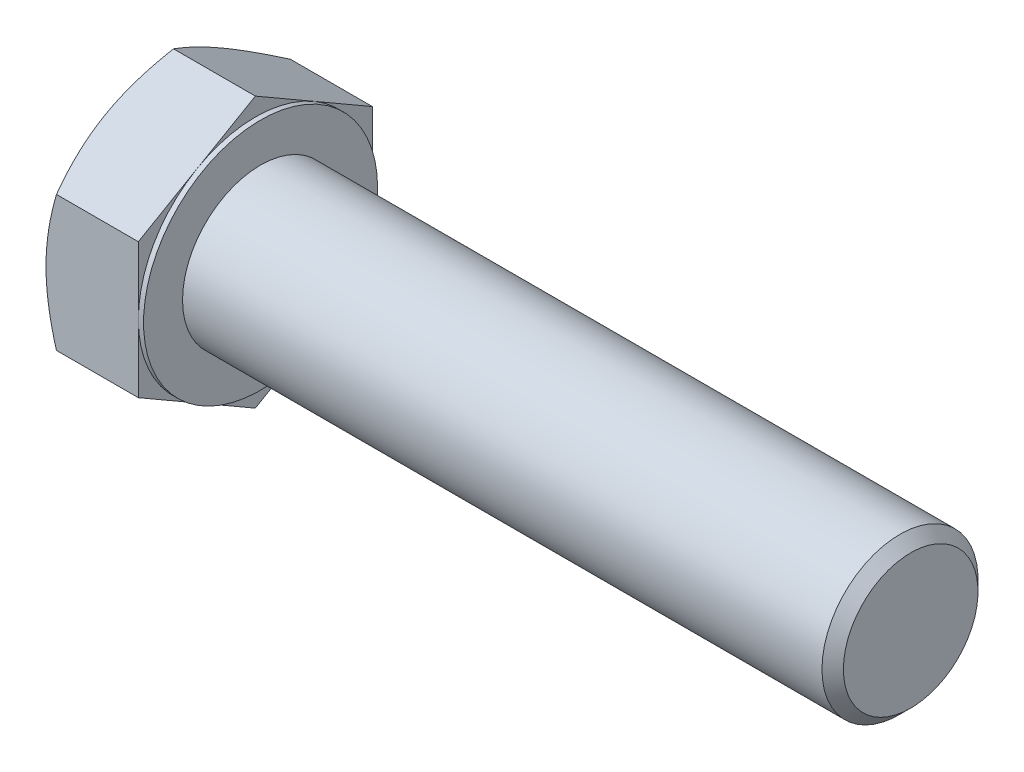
ISO-10303-21;
HEADER;
FILE_DESCRIPTION(('STEP AP214'),'2;1');
FILE_NAME('part.step','',(''),(''),'','','');
FILE_SCHEMA(('AUTOMOTIVE_DESIGN { 1 0 10303 214 1 1 1 1 }'));
ENDSEC;
DATA;
#1=APPLICATION_CONTEXT('core data for automotive mechanical design processes');
#2=APPLICATION_PROTOCOL_DEFINITION('international standard','automotive_design',2000,#1);
#3=PRODUCT_CONTEXT('',#1,'mechanical');
#4=PRODUCT('Part','Part','',(#3));
#5=PRODUCT_RELATED_PRODUCT_CATEGORY('part','',(#4));
#6=PRODUCT_DEFINITION_FORMATION('','',#4);
#7=PRODUCT_DEFINITION_CONTEXT('part definition',#1,'design');
#8=PRODUCT_DEFINITION('design','',#6,#7);
#9=PRODUCT_DEFINITION_SHAPE('','',#8);
#10=(LENGTH_UNIT() NAMED_UNIT(*) SI_UNIT(.MILLI.,.METRE.));
#11=(NAMED_UNIT(*) PLANE_ANGLE_UNIT() SI_UNIT($,.RADIAN.));
#12=(NAMED_UNIT(*) SI_UNIT($,.STERADIAN.) SOLID_ANGLE_UNIT());
#13=UNCERTAINTY_MEASURE_WITH_UNIT(LENGTH_MEASURE(1.E-05),#10,'distance_accuracy_value','');
#14=(GEOMETRIC_REPRESENTATION_CONTEXT(3) GLOBAL_UNCERTAINTY_ASSIGNED_CONTEXT((#13)) GLOBAL_UNIT_ASSIGNED_CONTEXT((#10,
#11,#12)) REPRESENTATION_CONTEXT('',''));
#15=CARTESIAN_POINT('',(0.,0.,0.));
#16=DIRECTION('',(0.,0.,1.));
#17=DIRECTION('',(1.,0.,0.));
#18=AXIS2_PLACEMENT_3D('',#15,#16,#17);
#19=CARTESIAN_POINT('',(15.,20.7846096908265,0.));
#20=DIRECTION('',(1.,0.,0.));
#21=DIRECTION('',(0.,0.,-1.));
#22=AXIS2_PLACEMENT_3D('',#19,#20,#21);
#23=PLANE('',#22);
#24=CARTESIAN_POINT('',(15.,0.,0.));
#25=DIRECTION('',(1.,0.,0.));
#26=DIRECTION('',(0.,0.,-1.));
#27=AXIS2_PLACEMENT_3D('',#24,#25,#26);
#28=CIRCLE('',#27,12.);
#29=CARTESIAN_POINT('',(15.,0.,-12.));
#30=VERTEX_POINT('',#29);
#31=EDGE_CURVE('E279',#30,#30,#28,.F.);
#32=ORIENTED_EDGE('',*,*,#31,.T.);
#33=EDGE_LOOP('',(#32));
#34=FACE_BOUND('',#33,.T.);
#35=CARTESIAN_POINT('',(15.,0.,0.));
#36=DIRECTION('',(1.,0.,0.));
#37=DIRECTION('',(0.,0.,-1.));
#38=AXIS2_PLACEMENT_3D('',#35,#36,#37);
#39=CIRCLE('',#38,18.);
#40=CARTESIAN_POINT('',(15.,0.,-18.));
#41=VERTEX_POINT('',#40);
#42=EDGE_CURVE('E298',#41,#41,#39,.T.);
#43=ORIENTED_EDGE('',*,*,#42,.T.);
#44=EDGE_LOOP('',(#43));
#45=FACE_BOUND('',#44,.T.);
#46=ADVANCED_FACE('F35',(#34,#45),#23,.T.);
#47=CARTESIAN_POINT('',(0.,0.,0.));
#48=DIRECTION('',(-1.,0.,0.));
#49=DIRECTION('',(0.,0.,1.));
#50=AXIS2_PLACEMENT_3D('',#47,#48,#49);
#51=CYLINDRICAL_SURFACE('',#50,12.);
#52=ORIENTED_EDGE('',*,*,#31,.F.);
#53=EDGE_LOOP('',(#52));
#54=FACE_BOUND('',#53,.T.);
#55=CARTESIAN_POINT('',(113.352,0.,0.));
#56=DIRECTION('',(-1.,0.,0.));
#57=DIRECTION('',(0.,0.,1.));
#58=AXIS2_PLACEMENT_3D('',#55,#56,#57);
#59=CIRCLE('',#58,12.);
#60=CARTESIAN_POINT('',(113.352,0.,12.));
#61=VERTEX_POINT('',#60);
#62=EDGE_CURVE('E276',#61,#61,#59,.T.);
#63=ORIENTED_EDGE('',*,*,#62,.T.);
#64=EDGE_LOOP('',(#63));
#65=FACE_BOUND('',#64,.T.);
#66=ADVANCED_FACE('F250',(#54,#65),#51,.T.);
#67=CARTESIAN_POINT('',(115.,0.,0.));
#68=DIRECTION('',(-1.,0.,0.));
#69=DIRECTION('',(0.,0.,1.));
#70=AXIS2_PLACEMENT_3D('',#67,#68,#69);
#71=CONICAL_SURFACE('',#70,10.352,0.785398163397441);
#72=ORIENTED_EDGE('',*,*,#62,.F.);
#73=EDGE_LOOP('',(#72));
#74=FACE_BOUND('',#73,.T.);
#75=CARTESIAN_POINT('',(115.,0.,0.));
#76=DIRECTION('',(-1.,0.,0.));
#77=DIRECTION('',(0.,0.,1.));
#78=AXIS2_PLACEMENT_3D('',#75,#76,#77);
#79=CIRCLE('',#78,10.352);
#80=CARTESIAN_POINT('',(115.,0.,10.352));
#81=VERTEX_POINT('',#80);
#82=EDGE_CURVE('E274',#81,#81,#79,.T.);
#83=ORIENTED_EDGE('',*,*,#82,.T.);
#84=EDGE_LOOP('',(#83));
#85=FACE_BOUND('',#84,.T.);
#86=ADVANCED_FACE('F255',(#74,#85),#71,.T.);
#87=CARTESIAN_POINT('',(115.,0.,0.));
#88=DIRECTION('',(-1.,0.,0.));
#89=DIRECTION('',(0.,0.,1.));
#90=AXIS2_PLACEMENT_3D('',#87,#88,#89);
#91=PLANE('',#90);
#92=ORIENTED_EDGE('',*,*,#82,.F.);
#93=EDGE_LOOP('',(#92));
#94=FACE_BOUND('',#93,.T.);
#95=ADVANCED_FACE('F262',(#94),#91,.F.);
#96=CARTESIAN_POINT('',(14.2,18.,0.));
#97=DIRECTION('',(1.,0.,0.));
#98=DIRECTION('',(0.,0.,-1.));
#99=AXIS2_PLACEMENT_3D('',#96,#97,#98);
#100=PLANE('',#99);
#101=DIRECTION('',(0.,0.500000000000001,0.866025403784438));
#102=VECTOR('',#101,1.);
#103=CARTESIAN_POINT('',(14.2,10.3923048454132,-18.));
#104=LINE('',#103,#102);
#105=CARTESIAN_POINT('',(14.2,10.3923048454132,-18.));
#106=VERTEX_POINT('',#105);
#107=CARTESIAN_POINT('',(14.2,15.5884572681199,-9.00000000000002));
#108=VERTEX_POINT('',#107);
#109=EDGE_CURVE('E168',#106,#108,#104,.T.);
#110=ORIENTED_EDGE('',*,*,#109,.T.);
#111=CARTESIAN_POINT('',(14.2,0.,0.));
#112=DIRECTION('',(-1.,0.,0.));
#113=DIRECTION('',(0.,0.,1.));
#114=AXIS2_PLACEMENT_3D('',#111,#112,#113);
#115=CIRCLE('',#114,18.);
#116=CARTESIAN_POINT('',(14.2,0.,-18.));
#117=VERTEX_POINT('',#116);
#118=EDGE_CURVE('E51',#108,#117,#115,.T.);
#119=ORIENTED_EDGE('',*,*,#118,.T.);
#120=DIRECTION('',(0.,1.,0.));
#121=VECTOR('',#120,1.);
#122=CARTESIAN_POINT('',(14.2,10.3923048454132,-18.));
#123=LINE('',#122,#121);
#124=EDGE_CURVE('E40',#117,#106,#123,.T.);
#125=ORIENTED_EDGE('',*,*,#124,.T.);
#126=EDGE_LOOP('',(#110,#119,#125));
#127=FACE_BOUND('',#126,.T.);
#128=ADVANCED_FACE('F265',(#127),#100,.T.);
#129=CARTESIAN_POINT('',(14.2,20.7846096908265,0.));
#130=VERTEX_POINT('',#129);
#131=EDGE_CURVE('E166',#108,#130,#104,.T.);
#132=ORIENTED_EDGE('',*,*,#131,.T.);
#133=DIRECTION('',(0.,-0.500000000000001,0.866025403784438));
#134=VECTOR('',#133,1.);
#135=CARTESIAN_POINT('',(14.2,20.7846096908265,0.));
#136=LINE('',#135,#134);
#137=CARTESIAN_POINT('',(14.2,15.5884572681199,9.00000000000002));
#138=VERTEX_POINT('',#137);
#139=EDGE_CURVE('E165',#130,#138,#136,.T.);
#140=ORIENTED_EDGE('',*,*,#139,.T.);
#141=EDGE_CURVE('E154',#138,#108,#115,.T.);
#142=ORIENTED_EDGE('',*,*,#141,.T.);
#143=EDGE_LOOP('',(#132,#140,#142));
#144=FACE_BOUND('',#143,.T.);
#145=ADVANCED_FACE('F270',(#144),#100,.T.);
#146=CARTESIAN_POINT('',(14.2,10.3923048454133,18.));
#147=VERTEX_POINT('',#146);
#148=EDGE_CURVE('E133',#138,#147,#136,.T.);
#149=ORIENTED_EDGE('',*,*,#148,.T.);
#150=DIRECTION('',(0.,-1.,0.));
#151=VECTOR('',#150,1.);
#152=CARTESIAN_POINT('',(14.2,10.3923048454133,18.));
#153=LINE('',#152,#151);
#154=CARTESIAN_POINT('',(14.2,0.,18.));
#155=VERTEX_POINT('',#154);
#156=EDGE_CURVE('E127',#147,#155,#153,.T.);
#157=ORIENTED_EDGE('',*,*,#156,.T.);
#158=EDGE_CURVE('E131',#155,#138,#115,.T.);
#159=ORIENTED_EDGE('',*,*,#158,.T.);
#160=EDGE_LOOP('',(#149,#157,#159));
#161=FACE_BOUND('',#160,.T.);
#162=ADVANCED_FACE('F129',(#161),#100,.T.);
#163=CARTESIAN_POINT('',(14.2,-10.3923048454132,18.));
#164=VERTEX_POINT('',#163);
#165=EDGE_CURVE('E137',#155,#164,#153,.T.);
#166=ORIENTED_EDGE('',*,*,#165,.T.);
#167=DIRECTION('',(0.,-0.500000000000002,-0.866025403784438));
#168=VECTOR('',#167,1.);
#169=CARTESIAN_POINT('',(14.2,-20.7846096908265,0.));
#170=LINE('',#169,#168);
#171=CARTESIAN_POINT('',(14.2,-15.5884572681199,9.00000000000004));
#172=VERTEX_POINT('',#171);
#173=EDGE_CURVE('E144',#164,#172,#170,.T.);
#174=ORIENTED_EDGE('',*,*,#173,.T.);
#175=EDGE_CURVE('E141',#172,#155,#115,.T.);
#176=ORIENTED_EDGE('',*,*,#175,.T.);
#177=EDGE_LOOP('',(#166,#174,#176));
#178=FACE_BOUND('',#177,.T.);
#179=ADVANCED_FACE('F142',(#178),#100,.T.);
#180=CARTESIAN_POINT('',(14.2,-20.7846096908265,0.));
#181=VERTEX_POINT('',#180);
#182=EDGE_CURVE('E160',#172,#181,#170,.T.);
#183=ORIENTED_EDGE('',*,*,#182,.T.);
#184=DIRECTION('',(0.,0.5,-0.866025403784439));
#185=VECTOR('',#184,1.);
#186=CARTESIAN_POINT('',(14.2,-10.3923048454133,-18.));
#187=LINE('',#186,#185);
#188=CARTESIAN_POINT('',(14.2,-15.5884572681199,-9.));
#189=VERTEX_POINT('',#188);
#190=EDGE_CURVE('E334',#181,#189,#187,.T.);
#191=ORIENTED_EDGE('',*,*,#190,.T.);
#192=EDGE_CURVE('E148',#189,#172,#115,.T.);
#193=ORIENTED_EDGE('',*,*,#192,.T.);
#194=EDGE_LOOP('',(#183,#191,#193));
#195=FACE_BOUND('',#194,.T.);
#196=ADVANCED_FACE('F339',(#195),#100,.T.);
#197=CARTESIAN_POINT('',(14.2,-10.3923048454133,-18.));
#198=VERTEX_POINT('',#197);
#199=EDGE_CURVE('E155',#189,#198,#187,.T.);
#200=ORIENTED_EDGE('',*,*,#199,.T.);
#201=EDGE_CURVE('E11',#198,#117,#123,.T.);
#202=ORIENTED_EDGE('',*,*,#201,.T.);
#203=EDGE_CURVE('E352',#117,#189,#115,.T.);
#204=ORIENTED_EDGE('',*,*,#203,.T.);
#205=EDGE_LOOP('',(#200,#202,#204));
#206=FACE_BOUND('',#205,.T.);
#207=ADVANCED_FACE('F271',(#206),#100,.T.);
#208=CARTESIAN_POINT('',(0.,0.,0.));
#209=DIRECTION('',(-1.,0.,0.));
#210=DIRECTION('',(0.,0.,1.));
#211=AXIS2_PLACEMENT_3D('',#208,#209,#210);
#212=CYLINDRICAL_SURFACE('',#211,18.);
#213=ORIENTED_EDGE('',*,*,#118,.F.);
#214=ORIENTED_EDGE('',*,*,#141,.F.);
#215=ORIENTED_EDGE('',*,*,#158,.F.);
#216=ORIENTED_EDGE('',*,*,#175,.F.);
#217=ORIENTED_EDGE('',*,*,#192,.F.);
#218=ORIENTED_EDGE('',*,*,#203,.F.);
#219=EDGE_LOOP('',(#213,#214,#215,#216,#217,#218));
#220=FACE_BOUND('',#219,.T.);
#221=ORIENTED_EDGE('',*,*,#42,.F.);
#222=EDGE_LOOP('',(#221));
#223=FACE_BOUND('',#222,.T.);
#224=ADVANCED_FACE('F151',(#220,#223),#212,.T.);
#225=CARTESIAN_POINT('',(0.,20.7846096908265,0.));
#226=DIRECTION('',(1.,0.,0.));
#227=DIRECTION('',(0.,0.,-1.));
#228=AXIS2_PLACEMENT_3D('',#225,#226,#227);
#229=PLANE('',#228);
#230=CARTESIAN_POINT('',(0.,0.,0.));
#231=DIRECTION('',(1.,0.,0.));
#232=DIRECTION('',(0.,0.,-1.));
#233=AXIS2_PLACEMENT_3D('',#230,#231,#232);
#234=CIRCLE('',#233,18.);
#235=CARTESIAN_POINT('',(0.,0.,-18.));
#236=VERTEX_POINT('',#235);
#237=CARTESIAN_POINT('',(0.,15.5884572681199,-9.00000000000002));
#238=VERTEX_POINT('',#237);
#239=EDGE_CURVE('E297',#236,#238,#234,.T.);
#240=ORIENTED_EDGE('',*,*,#239,.F.);
#241=CARTESIAN_POINT('',(0.,-15.5884572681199,-9.));
#242=VERTEX_POINT('',#241);
#243=EDGE_CURVE('E294',#242,#236,#234,.T.);
#244=ORIENTED_EDGE('',*,*,#243,.F.);
#245=CARTESIAN_POINT('',(0.,-15.5884572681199,9.00000000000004));
#246=VERTEX_POINT('',#245);
#247=EDGE_CURVE('E296',#246,#242,#234,.T.);
#248=ORIENTED_EDGE('',*,*,#247,.F.);
#249=CARTESIAN_POINT('',(0.,0.,18.));
#250=VERTEX_POINT('',#249);
#251=EDGE_CURVE('E306',#250,#246,#234,.T.);
#252=ORIENTED_EDGE('',*,*,#251,.F.);
#253=CARTESIAN_POINT('',(0.,0.,0.));
#254=DIRECTION('',(-1.,0.,0.));
#255=DIRECTION('',(0.,0.,1.));
#256=AXIS2_PLACEMENT_3D('',#253,#254,#255);
#257=CIRCLE('',#256,18.);
#258=CARTESIAN_POINT('',(0.,15.5884572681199,9.00000000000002));
#259=VERTEX_POINT('',#258);
#260=EDGE_CURVE('E169',#250,#259,#257,.T.);
#261=ORIENTED_EDGE('',*,*,#260,.T.);
#262=EDGE_CURVE('E301',#238,#259,#234,.T.);
#263=ORIENTED_EDGE('',*,*,#262,.F.);
#264=EDGE_LOOP('',(#240,#244,#248,#252,#261,#263));
#265=FACE_BOUND('',#264,.T.);
#266=ADVANCED_FACE('F200',(#265),#229,.F.);
#267=CARTESIAN_POINT('',(0.,0.,0.));
#268=DIRECTION('',(1.,0.,0.));
#269=DIRECTION('',(0.,0.,-1.));
#270=AXIS2_PLACEMENT_3D('',#267,#268,#269);
#271=CONICAL_SURFACE('',#270,18.,1.0471975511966);
#272=CARTESIAN_POINT('',(1.60776182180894,10.3921893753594,18.0002));
#273=CARTESIAN_POINT('',(1.47589336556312,10.6206079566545,17.6045674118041));
#274=CARTESIAN_POINT('',(1.35000889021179,10.8499174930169,17.2073916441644));
#275=CARTESIAN_POINT('',(1.11187123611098,11.310375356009,16.4098552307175));
#276=CARTESIAN_POINT('',(0.999622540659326,11.5415242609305,16.0094935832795));
#277=CARTESIAN_POINT('',(0.790265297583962,12.0061075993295,15.2048116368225));
#278=CARTESIAN_POINT('',(0.693192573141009,12.2395460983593,14.8004842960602));
#279=CARTESIAN_POINT('',(0.51627174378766,12.7080451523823,13.9890201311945));
#280=CARTESIAN_POINT('',(0.436422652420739,12.9431056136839,13.5818834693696));
#281=CARTESIAN_POINT('',(0.297345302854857,13.4088255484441,12.7752328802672));
#282=CARTESIAN_POINT('',(0.237656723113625,13.6394504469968,12.3757788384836));
#283=CARTESIAN_POINT('',(0.137572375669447,14.1017570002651,11.5750403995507));
#284=CARTESIAN_POINT('',(0.0971769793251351,14.3334386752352,11.1737559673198));
#285=CARTESIAN_POINT('',(0.0366989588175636,14.7971912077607,10.3705130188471));
#286=CARTESIAN_POINT('',(0.0165921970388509,15.0292612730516,9.96855587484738));
#287=CARTESIAN_POINT('',(-0.0028761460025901,15.4936156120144,9.16427056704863));
#288=CARTESIAN_POINT('',(-0.00223836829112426,15.7258998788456,8.76194241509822));
#289=CARTESIAN_POINT('',(0.0183335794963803,16.1601606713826,8.00978065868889));
#290=CARTESIAN_POINT('',(0.0357591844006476,16.3621681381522,7.65989346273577));
#291=CARTESIAN_POINT('',(0.0859690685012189,16.765701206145,6.96095368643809));
#292=CARTESIAN_POINT('',(0.118753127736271,16.9672268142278,6.61190109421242));
#293=CARTESIAN_POINT('',(0.199111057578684,17.3697198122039,5.91476277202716));
#294=CARTESIAN_POINT('',(0.246698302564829,17.5706865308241,5.56667820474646));
#295=CARTESIAN_POINT('',(0.355822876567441,17.9716632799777,4.87216610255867));
#296=CARTESIAN_POINT('',(0.417360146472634,18.1716733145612,4.52573856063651));
#297=CARTESIAN_POINT('',(0.624462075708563,18.7788295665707,3.47411308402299));
#298=CARTESIAN_POINT('',(0.790677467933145,19.1842175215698,2.77196054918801));
#299=CARTESIAN_POINT('',(1.1679181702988,19.9889486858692,1.37812528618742));
#300=CARTESIAN_POINT('',(1.3788548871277,20.3883021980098,0.686424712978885));
#301=CARTESIAN_POINT('',(1.60776182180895,20.7847251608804,-0.000200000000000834));
#302=B_SPLINE_CURVE_WITH_KNOTS('',3,(#272,#273,#274,#275,#276,#277,#278,#279,#280,#281,#282,
#283,#284,#285,#286,#287,#288,#289,#290,#291,#292,#293,#294,#295,#296,#297,#298,#299,#300,#301),
.UNSPECIFIED.,.F.,.F.,(4,2,2,2,2,2,2,2,2,2,2,2,2,2,4),(0.,1.42650335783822,2.85347447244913,
4.28376471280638,5.71397301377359,7.10888071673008,8.50381526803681,9.8970882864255,
11.2903182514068,12.5031974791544,13.7160593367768,14.9300201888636,16.1439758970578,
18.6253607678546,21.1018751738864),.UNSPECIFIED.);
#303=CARTESIAN_POINT('',(1.60769515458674,20.7846096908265,0.));
#304=VERTEX_POINT('',#303);
#305=EDGE_CURVE('E219',#259,#304,#302,.T.);
#306=ORIENTED_EDGE('',*,*,#305,.T.);
#307=CARTESIAN_POINT('',(1.60776182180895,20.7847251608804,0.0002));
#308=CARTESIAN_POINT('',(1.47589336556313,20.5563065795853,-0.395432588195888));
#309=CARTESIAN_POINT('',(1.3500088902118,20.3269970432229,-0.79260835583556));
#310=CARTESIAN_POINT('',(1.11187123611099,19.8665391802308,-1.59014476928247));
#311=CARTESIAN_POINT('',(0.999622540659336,19.6353902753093,-1.99050641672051));
#312=CARTESIAN_POINT('',(0.790265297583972,19.1708069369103,-2.79518836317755));
#313=CARTESIAN_POINT('',(0.69319257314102,18.9373684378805,-3.19951570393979));
#314=CARTESIAN_POINT('',(0.516271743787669,18.4688693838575,-4.01097986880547));
#315=CARTESIAN_POINT('',(0.436422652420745,18.2338089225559,-4.41811653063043));
#316=CARTESIAN_POINT('',(0.297345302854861,17.7680889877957,-5.22476711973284));
#317=CARTESIAN_POINT('',(0.237656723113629,17.537464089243,-5.62422116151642));
#318=CARTESIAN_POINT('',(0.13757237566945,17.0751575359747,-6.42495960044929));
#319=CARTESIAN_POINT('',(0.0971769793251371,16.8434758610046,-6.82624403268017));
#320=CARTESIAN_POINT('',(0.0366989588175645,16.3797233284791,-7.62948698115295));
#321=CARTESIAN_POINT('',(0.0165921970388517,16.1476532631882,-8.03144412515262));
#322=CARTESIAN_POINT('',(-0.00287614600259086,15.6832989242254,-8.83572943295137));
#323=CARTESIAN_POINT('',(-0.00223836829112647,15.4510146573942,-9.23805758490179));
#324=CARTESIAN_POINT('',(0.0183335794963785,15.0167538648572,-9.99021934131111));
#325=CARTESIAN_POINT('',(0.0357591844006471,14.8147463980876,-10.3401065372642));
#326=CARTESIAN_POINT('',(0.0859690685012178,14.4112133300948,-11.0390463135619));
#327=CARTESIAN_POINT('',(0.118753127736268,14.209687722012,-11.3880989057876));
#328=CARTESIAN_POINT('',(0.199111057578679,13.8071947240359,-12.0852372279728));
#329=CARTESIAN_POINT('',(0.246698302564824,13.6062280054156,-12.4333217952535));
#330=CARTESIAN_POINT('',(0.355822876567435,13.2052512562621,-13.1278338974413));
#331=CARTESIAN_POINT('',(0.417360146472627,13.0052412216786,-13.4742614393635));
#332=CARTESIAN_POINT('',(0.624462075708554,12.3980849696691,-14.525886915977));
#333=CARTESIAN_POINT('',(0.790677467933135,11.99269701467,-15.228039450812));
#334=CARTESIAN_POINT('',(1.16791817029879,11.1879658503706,-16.6218747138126));
#335=CARTESIAN_POINT('',(1.37885488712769,10.78861233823,-17.3135752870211));
#336=CARTESIAN_POINT('',(1.60776182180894,10.3921893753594,-18.0002));
#337=B_SPLINE_CURVE_WITH_KNOTS('',3,(#307,#308,#309,#310,#311,#312,#313,#314,#315,#316,#317,
#318,#319,#320,#321,#322,#323,#324,#325,#326,#327,#328,#329,#330,#331,#332,#333,#334,#335,#336),
.UNSPECIFIED.,.F.,.F.,(4,2,2,2,2,2,2,2,2,2,2,2,2,2,4),(0.,1.42650335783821,2.85347447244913,
4.28376471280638,5.71397301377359,7.10888071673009,8.50381526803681,9.89708828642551,
11.2903182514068,12.5031974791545,13.7160593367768,14.9300201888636,16.1439758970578,
18.6253607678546,21.1018751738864),.UNSPECIFIED.);
#338=EDGE_CURVE('E59',#304,#238,#337,.T.);
#339=ORIENTED_EDGE('',*,*,#338,.T.);
#340=ORIENTED_EDGE('',*,*,#262,.T.);
#341=EDGE_LOOP('',(#306,#339,#340));
#342=FACE_BOUND('',#341,.T.);
#343=ADVANCED_FACE('F348',(#342),#271,.T.);
#344=CARTESIAN_POINT('',(8.808427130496,-27.9643402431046,18.));
#345=CARTESIAN_POINT('',(8.61750677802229,-27.5710662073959,18.));
#346=CARTESIAN_POINT('',(8.42753472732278,-27.1773320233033,18.));
#347=CARTESIAN_POINT('',(8.04970189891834,-26.3888473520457,18.));
#348=CARTESIAN_POINT('',(7.86184114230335,-25.9940968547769,18.));
#349=CARTESIAN_POINT('',(7.30169863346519,-24.8080724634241,18.));
#350=CARTESIAN_POINT('',(6.93291289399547,-24.0151412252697,18.));
#351=CARTESIAN_POINT('',(6.20490967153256,-22.4196974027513,18.));
#352=CARTESIAN_POINT('',(5.84575478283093,-21.6171561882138,18.));
#353=CARTESIAN_POINT('',(5.14207064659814,-20.0057089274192,18.));
#354=CARTESIAN_POINT('',(4.79754071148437,-19.1968031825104,18.));
#355=CARTESIAN_POINT('',(4.11611022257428,-17.5450041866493,18.));
#356=CARTESIAN_POINT('',(3.77981809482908,-16.7018586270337,18.));
#357=CARTESIAN_POINT('',(3.13256514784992,-15.0057154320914,18.));
#358=CARTESIAN_POINT('',(2.82160716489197,-14.1527167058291,18.));
#359=CARTESIAN_POINT('',(2.23315455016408,-12.43711867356,18.));
#360=CARTESIAN_POINT('',(1.95559259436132,-11.5745426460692,18.));
#361=CARTESIAN_POINT('',(1.44279031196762,-9.83693542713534,18.));
#362=CARTESIAN_POINT('',(1.20753670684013,-8.96190823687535,18.));
#363=CARTESIAN_POINT('',(0.895522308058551,-7.64230427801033,18.));
#364=CARTESIAN_POINT('',(0.798539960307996,-7.20248011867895,18.));
#365=CARTESIAN_POINT('',(0.619346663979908,-6.31981731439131,18.));
#366=CARTESIAN_POINT('',(0.537135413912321,-5.87697873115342,18.));
#367=CARTESIAN_POINT('',(0.388933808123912,-4.98859702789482,18.));
#368=CARTESIAN_POINT('',(0.322942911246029,-4.54305399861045,18.));
#369=CARTESIAN_POINT('',(0.208492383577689,-3.64970631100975,18.));
#370=CARTESIAN_POINT('',(0.160032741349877,-3.20190165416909,18.));
#371=CARTESIAN_POINT('',(0.0822220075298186,-2.3105496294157,18.));
#372=CARTESIAN_POINT('',(0.0526283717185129,-1.86702356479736,18.));
#373=CARTESIAN_POINT('',(0.0122265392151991,-0.979118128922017,18.));
#374=CARTESIAN_POINT('',(0.001418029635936,-0.534738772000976,18.));
#375=CARTESIAN_POINT('',(-0.00115631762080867,0.354079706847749,18.));
#376=CARTESIAN_POINT('',(0.00707792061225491,0.798518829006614,18.));
#377=CARTESIAN_POINT('',(0.0423876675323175,1.68665283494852,18.));
#378=CARTESIAN_POINT('',(0.0694640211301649,2.13034768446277,18.));
#379=CARTESIAN_POINT('',(0.156482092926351,3.19520589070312,18.));
#380=CARTESIAN_POINT('',(0.225281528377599,3.81565824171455,18.));
#381=CARTESIAN_POINT('',(0.395990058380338,5.05199420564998,18.));
#382=CARTESIAN_POINT('',(0.497903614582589,5.66787719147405,18.));
#383=CARTESIAN_POINT('',(0.731215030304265,6.89447554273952,18.));
#384=CARTESIAN_POINT('',(0.862635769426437,7.50518651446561,18.));
#385=CARTESIAN_POINT('',(1.15094813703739,8.72049972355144,18.));
#386=CARTESIAN_POINT('',(1.30783938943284,9.3251020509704,18.));
#387=CARTESIAN_POINT('',(1.64698004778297,10.5414936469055,18.));
#388=CARTESIAN_POINT('',(1.82971241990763,11.1531473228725,18.));
#389=CARTESIAN_POINT('',(2.21414736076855,12.3704299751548,18.));
#390=CARTESIAN_POINT('',(2.41585005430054,12.9760589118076,18.));
#391=CARTESIAN_POINT('',(2.83501520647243,14.1815895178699,18.));
#392=CARTESIAN_POINT('',(3.05247247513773,14.7814930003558,18.));
#393=CARTESIAN_POINT('',(3.50057968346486,15.9763233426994,18.));
#394=CARTESIAN_POINT('',(3.73122947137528,16.5712502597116,18.));
#395=CARTESIAN_POINT('',(4.28861115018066,17.9702204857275,18.));
#396=CARTESIAN_POINT('',(4.62002515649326,18.7723954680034,18.));
#397=CARTESIAN_POINT('',(5.29890820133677,20.3699430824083,18.));
#398=CARTESIAN_POINT('',(5.64637822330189,21.1653152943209,18.));
#399=CARTESIAN_POINT('',(6.35417286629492,22.7505167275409,18.));
#400=CARTESIAN_POINT('',(6.7145003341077,23.5403446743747,18.));
#401=CARTESIAN_POINT('',(7.44542750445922,25.1152008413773,18.));
#402=CARTESIAN_POINT('',(7.81602698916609,25.9002291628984,18.));
#403=CARTESIAN_POINT('',(8.56599428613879,27.4671332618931,18.));
#404=CARTESIAN_POINT('',(8.94537123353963,28.2490046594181,18.));
#405=CARTESIAN_POINT('',(9.71100797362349,29.8093695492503,18.));
#406=CARTESIAN_POINT('',(10.0972677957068,30.5878630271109,18.));
#407=CARTESIAN_POINT('',(10.8754456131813,32.1418914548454,18.));
#408=CARTESIAN_POINT('',(11.2673628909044,32.9174267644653,18.));
#409=CARTESIAN_POINT('',(12.0559785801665,34.4660583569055,18.));
#410=CARTESIAN_POINT('',(12.4526769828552,35.2391546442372,18.));
#411=CARTESIAN_POINT('',(13.5822142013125,37.4263866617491,18.));
#412=CARTESIAN_POINT('',(14.3197969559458,38.8380724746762,18.));
#413=CARTESIAN_POINT('',(15.8050655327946,41.6561700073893,18.));
#414=CARTESIAN_POINT('',(16.5527517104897,43.0625815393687,18.));
#415=CARTESIAN_POINT('',(18.0539928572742,45.8677641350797,18.));
#416=CARTESIAN_POINT('',(18.8075285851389,47.2665455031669,18.));
#417=CARTESIAN_POINT('',(19.942334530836,49.3622270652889,18.));
#418=CARTESIAN_POINT('',(20.3213432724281,50.0603536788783,18.));
#419=CARTESIAN_POINT('',(21.0807116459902,51.4558704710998,18.));
#420=CARTESIAN_POINT('',(21.4610712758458,52.1532606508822,18.));
#421=CARTESIAN_POINT('',(21.8420286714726,52.850324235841,18.));
#422=B_SPLINE_CURVE_WITH_KNOTS('',3,(#344,#345,#346,#347,#348,#349,#350,#351,#352,#353,#354,
#355,#356,#357,#358,#359,#360,#361,#362,#363,#364,#365,#366,#367,#368,#369,#370,#371,#372,#373,
#374,#375,#376,#377,#378,#379,#380,#381,#382,#383,#384,#385,#386,#387,#388,#389,#390,#391,#392,
#393,#394,#395,#396,#397,#398,#399,#400,#401,#402,#403,#404,#405,#406,#407,#408,#409,#410,#411,
#412,#413,#414,#415,#416,#417,#418,#419,#420,#421),.UNSPECIFIED.,.F.,.F.,(4,2,2,2,2,2,2,2,2,2,2,
2,2,2,2,2,2,2,2,2,2,2,2,2,2,2,2,2,2,2,2,2,2,2,2,2,2,2,4),(0.,1.31149885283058,2.62301079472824,
5.24642021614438,7.88402931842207,10.5215142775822,13.2444150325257,15.9676202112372,
18.6852401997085,21.402005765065,22.7529669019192,24.1039004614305,25.454788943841,
26.8056765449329,28.1388267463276,29.4719547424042,30.8050880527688,32.138281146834,
34.0100119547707,35.8819950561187,37.7554347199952,39.628846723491,41.5435776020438,
43.4583210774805,45.3724366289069,47.286530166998,49.890113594,52.4938567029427,
55.0981799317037,57.7024479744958,60.3095605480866,62.9166842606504,65.5234801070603,
68.1302711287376,72.908489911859,77.6868772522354,82.4533702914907,84.8364880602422,
87.2196021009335),.UNSPECIFIED.);
#423=CARTESIAN_POINT('',(1.60769515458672,10.3923048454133,18.));
#424=VERTEX_POINT('',#423);
#425=EDGE_CURVE('E233',#250,#424,#422,.T.);
#426=ORIENTED_EDGE('',*,*,#425,.T.);
#427=EDGE_CURVE('E232',#424,#259,#302,.T.);
#428=ORIENTED_EDGE('',*,*,#427,.T.);
#429=ORIENTED_EDGE('',*,*,#260,.F.);
#430=EDGE_LOOP('',(#426,#428,#429));
#431=FACE_BOUND('',#430,.T.);
#432=ADVANCED_FACE('F344',(#431),#271,.T.);
#433=CARTESIAN_POINT('',(1.60769515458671,-10.3923048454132,18.));
#434=VERTEX_POINT('',#433);
#435=EDGE_CURVE('E277',#434,#250,#422,.T.);
#436=ORIENTED_EDGE('',*,*,#435,.T.);
#437=ORIENTED_EDGE('',*,*,#251,.T.);
#438=CARTESIAN_POINT('',(1.60776182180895,-20.7847251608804,-0.000200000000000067));
#439=CARTESIAN_POINT('',(1.47589336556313,-20.5563065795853,0.395432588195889));
#440=CARTESIAN_POINT('',(1.3500088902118,-20.3269970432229,0.79260835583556));
#441=CARTESIAN_POINT('',(1.11187123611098,-19.8665391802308,1.59014476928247));
#442=CARTESIAN_POINT('',(0.999622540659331,-19.6353902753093,1.99050641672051));
#443=CARTESIAN_POINT('',(0.790265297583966,-19.1708069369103,2.79518836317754));
#444=CARTESIAN_POINT('',(0.693192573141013,-18.9373684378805,3.19951570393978));
#445=CARTESIAN_POINT('',(0.516271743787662,-18.4688693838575,4.01097986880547));
#446=CARTESIAN_POINT('',(0.43642265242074,-18.2338089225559,4.41811653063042));
#447=CARTESIAN_POINT('',(0.297345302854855,-17.7680889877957,5.22476711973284));
#448=CARTESIAN_POINT('',(0.237656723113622,-17.537464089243,5.62422116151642));
#449=CARTESIAN_POINT('',(0.137572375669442,-17.0751575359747,6.42495960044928));
#450=CARTESIAN_POINT('',(0.0971769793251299,-16.8434758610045,6.82624403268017));
#451=CARTESIAN_POINT('',(0.0366989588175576,-16.3797233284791,7.62948698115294));
#452=CARTESIAN_POINT('',(0.0165921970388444,-16.1476532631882,8.03144412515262));
#453=CARTESIAN_POINT('',(-0.00287614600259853,-15.6832989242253,8.83572943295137));
#454=CARTESIAN_POINT('',(-0.00223836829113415,-15.4510146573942,9.23805758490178));
#455=CARTESIAN_POINT('',(0.0183335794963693,-15.0167538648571,9.9902193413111));
#456=CARTESIAN_POINT('',(0.0357591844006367,-14.8147463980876,10.3401065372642));
#457=CARTESIAN_POINT('',(0.0859690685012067,-14.4112133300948,11.0390463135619));
#458=CARTESIAN_POINT('',(0.118753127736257,-14.209687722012,11.3880989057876));
#459=CARTESIAN_POINT('',(0.199111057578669,-13.8071947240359,12.0852372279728));
#460=CARTESIAN_POINT('',(0.246698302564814,-13.6062280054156,12.4333217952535));
#461=CARTESIAN_POINT('',(0.355822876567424,-13.2052512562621,13.1278338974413));
#462=CARTESIAN_POINT('',(0.417360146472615,-13.0052412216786,13.4742614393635));
#463=CARTESIAN_POINT('',(0.624462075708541,-12.3980849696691,14.525886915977));
#464=CARTESIAN_POINT('',(0.790677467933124,-11.99269701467,15.228039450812));
#465=CARTESIAN_POINT('',(1.16791817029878,-11.1879658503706,16.6218747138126));
#466=CARTESIAN_POINT('',(1.37885488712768,-10.78861233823,17.3135752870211));
#467=CARTESIAN_POINT('',(1.60776182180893,-10.3921893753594,18.0002));
#468=B_SPLINE_CURVE_WITH_KNOTS('',3,(#438,#439,#440,#441,#442,#443,#444,#445,#446,#447,#448,
#449,#450,#451,#452,#453,#454,#455,#456,#457,#458,#459,#460,#461,#462,#463,#464,#465,#466,#467),
.UNSPECIFIED.,.F.,.F.,(4,2,2,2,2,2,2,2,2,2,2,2,2,2,4),(0.,1.42650335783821,2.85347447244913,
4.28376471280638,5.71397301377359,7.10888071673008,8.50381526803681,9.89708828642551,
11.2903182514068,12.5031974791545,13.7160593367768,14.9300201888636,16.1439758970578,
18.6253607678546,21.1018751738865),.UNSPECIFIED.);
#469=EDGE_CURVE('E221',#246,#434,#468,.T.);
#470=ORIENTED_EDGE('',*,*,#469,.T.);
#471=EDGE_LOOP('',(#436,#437,#470));
#472=FACE_BOUND('',#471,.T.);
#473=ADVANCED_FACE('F189',(#472),#271,.T.);
#474=CARTESIAN_POINT('',(1.60769515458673,-20.7846096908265,0.));
#475=VERTEX_POINT('',#474);
#476=EDGE_CURVE('E213',#475,#246,#468,.T.);
#477=ORIENTED_EDGE('',*,*,#476,.T.);
#478=ORIENTED_EDGE('',*,*,#247,.T.);
#479=CARTESIAN_POINT('',(1.60776182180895,-10.3921893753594,-18.0002));
#480=CARTESIAN_POINT('',(1.47589336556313,-10.6206079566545,-17.6045674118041));
#481=CARTESIAN_POINT('',(1.3500088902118,-10.8499174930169,-17.2073916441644));
#482=CARTESIAN_POINT('',(1.11187123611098,-11.310375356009,-16.4098552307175));
#483=CARTESIAN_POINT('',(0.999622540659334,-11.5415242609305,-16.0094935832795));
#484=CARTESIAN_POINT('',(0.79026529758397,-12.0061075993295,-15.2048116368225));
#485=CARTESIAN_POINT('',(0.693192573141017,-12.2395460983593,-14.8004842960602));
#486=CARTESIAN_POINT('',(0.516271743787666,-12.7080451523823,-13.9890201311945));
#487=CARTESIAN_POINT('',(0.436422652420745,-12.9431056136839,-13.5818834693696));
#488=CARTESIAN_POINT('',(0.297345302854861,-13.4088255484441,-12.7752328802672));
#489=CARTESIAN_POINT('',(0.237656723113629,-13.6394504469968,-12.3757788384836));
#490=CARTESIAN_POINT('',(0.137572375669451,-14.1017570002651,-11.5750403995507));
#491=CARTESIAN_POINT('',(0.0971769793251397,-14.3334386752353,-11.1737559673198));
#492=CARTESIAN_POINT('',(0.036698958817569,-14.7971912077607,-10.370513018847));
#493=CARTESIAN_POINT('',(0.0165921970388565,-15.0292612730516,-9.96855587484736));
#494=CARTESIAN_POINT('',(-0.00287614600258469,-15.4936156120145,-9.16427056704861));
#495=CARTESIAN_POINT('',(-0.00223836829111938,-15.7258998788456,-8.7619424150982));
#496=CARTESIAN_POINT('',(0.0183335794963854,-16.1601606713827,-8.00978065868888));
#497=CARTESIAN_POINT('',(0.0357591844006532,-16.3621681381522,-7.65989346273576));
#498=CARTESIAN_POINT('',(0.0859690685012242,-16.765701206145,-6.96095368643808));
#499=CARTESIAN_POINT('',(0.118753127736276,-16.9672268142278,-6.61190109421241));
#500=CARTESIAN_POINT('',(0.199111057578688,-17.3697198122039,-5.91476277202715));
#501=CARTESIAN_POINT('',(0.246698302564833,-17.5706865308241,-5.56667820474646));
#502=CARTESIAN_POINT('',(0.355822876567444,-17.9716632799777,-4.87216610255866));
#503=CARTESIAN_POINT('',(0.417360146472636,-18.1716733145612,-4.5257385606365));
#504=CARTESIAN_POINT('',(0.624462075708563,-18.7788295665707,-3.47411308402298));
#505=CARTESIAN_POINT('',(0.790677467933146,-19.1842175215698,-2.77196054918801));
#506=CARTESIAN_POINT('',(1.1679181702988,-19.9889486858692,-1.37812528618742));
#507=CARTESIAN_POINT('',(1.3788548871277,-20.3883021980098,-0.686424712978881));
#508=CARTESIAN_POINT('',(1.60776182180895,-20.7847251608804,0.000200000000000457));
#509=B_SPLINE_CURVE_WITH_KNOTS('',3,(#479,#480,#481,#482,#483,#484,#485,#486,#487,#488,#489,
#490,#491,#492,#493,#494,#495,#496,#497,#498,#499,#500,#501,#502,#503,#504,#505,#506,#507,#508),
.UNSPECIFIED.,.F.,.F.,(4,2,2,2,2,2,2,2,2,2,2,2,2,2,4),(0.,1.42650335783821,2.85347447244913,
4.28376471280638,5.71397301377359,7.10888071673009,8.50381526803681,9.89708828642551,
11.2903182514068,12.5031974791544,13.7160593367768,14.9300201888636,16.1439758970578,
18.6253607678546,21.1018751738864),.UNSPECIFIED.);
#510=EDGE_CURVE('E220',#242,#475,#509,.T.);
#511=ORIENTED_EDGE('',*,*,#510,.T.);
#512=EDGE_LOOP('',(#477,#478,#511));
#513=FACE_BOUND('',#512,.T.);
#514=ADVANCED_FACE('F315',(#513),#271,.T.);
#515=CARTESIAN_POINT('',(1.60769515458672,10.3923048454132,-18.));
#516=VERTEX_POINT('',#515);
#517=EDGE_CURVE('E222',#238,#516,#337,.T.);
#518=ORIENTED_EDGE('',*,*,#517,.T.);
#519=CARTESIAN_POINT('',(8.80842713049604,-27.9643402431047,-18.));
#520=CARTESIAN_POINT('',(8.61750677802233,-27.5710662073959,-18.));
#521=CARTESIAN_POINT('',(8.42753472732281,-27.1773320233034,-18.));
#522=CARTESIAN_POINT('',(8.04970189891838,-26.3888473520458,-18.));
#523=CARTESIAN_POINT('',(7.86184114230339,-25.994096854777,-18.));
#524=CARTESIAN_POINT('',(7.30169863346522,-24.8080724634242,-18.));
#525=CARTESIAN_POINT('',(6.9329128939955,-24.0151412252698,-18.));
#526=CARTESIAN_POINT('',(6.20490967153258,-22.4196974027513,-18.));
#527=CARTESIAN_POINT('',(5.84575478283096,-21.6171561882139,-18.));
#528=CARTESIAN_POINT('',(5.14207064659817,-20.0057089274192,-18.));
#529=CARTESIAN_POINT('',(4.79754071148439,-19.1968031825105,-18.));
#530=CARTESIAN_POINT('',(4.11611022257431,-17.5450041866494,-18.));
#531=CARTESIAN_POINT('',(3.7798180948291,-16.7018586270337,-18.));
#532=CARTESIAN_POINT('',(3.13256514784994,-15.0057154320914,-18.));
#533=CARTESIAN_POINT('',(2.82160716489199,-14.1527167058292,-18.));
#534=CARTESIAN_POINT('',(2.23315455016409,-12.4371186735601,-18.));
#535=CARTESIAN_POINT('',(1.95559259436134,-11.5745426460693,-18.));
#536=CARTESIAN_POINT('',(1.44279031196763,-9.83693542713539,-18.));
#537=CARTESIAN_POINT('',(1.20753670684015,-8.9619082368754,-18.));
#538=CARTESIAN_POINT('',(0.895522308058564,-7.64230427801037,-18.));
#539=CARTESIAN_POINT('',(0.79853996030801,-7.202480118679,-18.));
#540=CARTESIAN_POINT('',(0.619346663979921,-6.31981731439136,-18.));
#541=CARTESIAN_POINT('',(0.537135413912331,-5.87697873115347,-18.));
#542=CARTESIAN_POINT('',(0.38893380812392,-4.98859702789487,-18.));
#543=CARTESIAN_POINT('',(0.322942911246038,-4.5430539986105,-18.));
#544=CARTESIAN_POINT('',(0.208492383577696,-3.64970631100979,-18.));
#545=CARTESIAN_POINT('',(0.160032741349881,-3.20190165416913,-18.));
#546=CARTESIAN_POINT('',(0.0822220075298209,-2.31054962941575,-18.));
#547=CARTESIAN_POINT('',(0.0526283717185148,-1.8670235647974,-18.));
#548=CARTESIAN_POINT('',(0.0122265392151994,-0.979118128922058,-18.));
#549=CARTESIAN_POINT('',(0.00141802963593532,-0.534738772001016,-18.));
#550=CARTESIAN_POINT('',(-0.00115631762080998,0.354079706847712,-18.));
#551=CARTESIAN_POINT('',(0.00707792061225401,0.798518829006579,-18.));
#552=CARTESIAN_POINT('',(0.0423876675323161,1.68665283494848,-18.));
#553=CARTESIAN_POINT('',(0.0694640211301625,2.13034768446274,-18.));
#554=CARTESIAN_POINT('',(0.156482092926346,3.19520589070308,-18.));
#555=CARTESIAN_POINT('',(0.225281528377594,3.81565824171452,-18.));
#556=CARTESIAN_POINT('',(0.395990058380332,5.05199420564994,-18.));
#557=CARTESIAN_POINT('',(0.497903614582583,5.66787719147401,-18.));
#558=CARTESIAN_POINT('',(0.731215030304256,6.89447554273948,-18.));
#559=CARTESIAN_POINT('',(0.862635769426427,7.50518651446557,-18.));
#560=CARTESIAN_POINT('',(1.15094813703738,8.72049972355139,-18.));
#561=CARTESIAN_POINT('',(1.30783938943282,9.32510205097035,-18.));
#562=CARTESIAN_POINT('',(1.64698004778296,10.5414936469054,-18.));
#563=CARTESIAN_POINT('',(1.82971241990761,11.1531473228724,-18.));
#564=CARTESIAN_POINT('',(2.21414736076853,12.3704299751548,-18.));
#565=CARTESIAN_POINT('',(2.41585005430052,12.9760589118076,-18.));
#566=CARTESIAN_POINT('',(2.83501520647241,14.1815895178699,-18.));
#567=CARTESIAN_POINT('',(3.05247247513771,14.7814930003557,-18.));
#568=CARTESIAN_POINT('',(3.50057968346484,15.9763233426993,-18.));
#569=CARTESIAN_POINT('',(3.73122947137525,16.5712502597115,-18.));
#570=CARTESIAN_POINT('',(4.28861115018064,17.9702204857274,-18.));
#571=CARTESIAN_POINT('',(4.62002515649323,18.7723954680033,-18.));
#572=CARTESIAN_POINT('',(5.29890820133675,20.3699430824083,-18.));
#573=CARTESIAN_POINT('',(5.64637822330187,21.1653152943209,-18.));
#574=CARTESIAN_POINT('',(6.3541728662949,22.7505167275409,-18.));
#575=CARTESIAN_POINT('',(6.71450033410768,23.5403446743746,-18.));
#576=CARTESIAN_POINT('',(7.4454275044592,25.1152008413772,-18.));
#577=CARTESIAN_POINT('',(7.81602698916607,25.9002291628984,-18.));
#578=CARTESIAN_POINT('',(8.56599428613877,27.467133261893,-18.));
#579=CARTESIAN_POINT('',(8.94537123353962,28.2490046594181,-18.));
#580=CARTESIAN_POINT('',(9.71100797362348,29.8093695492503,-18.));
#581=CARTESIAN_POINT('',(10.0972677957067,30.5878630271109,-18.));
#582=CARTESIAN_POINT('',(10.8754456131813,32.1418914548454,-18.));
#583=CARTESIAN_POINT('',(11.2673628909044,32.9174267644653,-18.));
#584=CARTESIAN_POINT('',(12.0559785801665,34.4660583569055,-18.));
#585=CARTESIAN_POINT('',(12.4526769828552,35.2391546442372,-18.));
#586=CARTESIAN_POINT('',(13.5822142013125,37.4263866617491,-18.));
#587=CARTESIAN_POINT('',(14.3197969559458,38.8380724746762,-18.));
#588=CARTESIAN_POINT('',(15.8050655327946,41.6561700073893,-18.));
#589=CARTESIAN_POINT('',(16.5527517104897,43.0625815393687,-18.));
#590=CARTESIAN_POINT('',(18.0539928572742,45.8677641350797,-18.));
#591=CARTESIAN_POINT('',(18.8075285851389,47.2665455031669,-18.));
#592=CARTESIAN_POINT('',(19.942334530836,49.3622270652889,-18.));
#593=CARTESIAN_POINT('',(20.3213432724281,50.0603536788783,-18.));
#594=CARTESIAN_POINT('',(21.0807116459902,51.4558704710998,-18.));
#595=CARTESIAN_POINT('',(21.4610712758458,52.1532606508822,-18.));
#596=CARTESIAN_POINT('',(21.8420286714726,52.850324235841,-18.));
#597=B_SPLINE_CURVE_WITH_KNOTS('',3,(#519,#520,#521,#522,#523,#524,#525,#526,#527,#528,#529,
#530,#531,#532,#533,#534,#535,#536,#537,#538,#539,#540,#541,#542,#543,#544,#545,#546,#547,#548,
#549,#550,#551,#552,#553,#554,#555,#556,#557,#558,#559,#560,#561,#562,#563,#564,#565,#566,#567,
#568,#569,#570,#571,#572,#573,#574,#575,#576,#577,#578,#579,#580,#581,#582,#583,#584,#585,#586,
#587,#588,#589,#590,#591,#592,#593,#594,#595,#596),.UNSPECIFIED.,.F.,.F.,(4,2,2,2,2,2,2,2,2,2,2,
2,2,2,2,2,2,2,2,2,2,2,2,2,2,2,2,2,2,2,2,2,2,2,2,2,2,2,4),(0.,1.31149885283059,2.62301079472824,
5.24642021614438,7.88402931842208,10.5215142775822,13.2444150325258,15.9676202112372,
18.6852401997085,21.402005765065,22.7529669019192,24.1039004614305,25.454788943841,
26.805676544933,28.1388267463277,29.4719547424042,30.8050880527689,32.1382811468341,
34.0100119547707,35.8819950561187,37.7554347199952,39.628846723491,41.5435776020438,
43.4583210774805,45.3724366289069,47.286530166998,49.8901135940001,52.4938567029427,
55.0981799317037,57.7024479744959,60.3095605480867,62.9166842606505,65.5234801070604,
68.1302711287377,72.9084899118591,77.6868772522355,82.4533702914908,84.8364880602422,
87.2196021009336),.UNSPECIFIED.);
#598=EDGE_CURVE('E181',#516,#236,#597,.F.);
#599=ORIENTED_EDGE('',*,*,#598,.T.);
#600=ORIENTED_EDGE('',*,*,#239,.T.);
#601=EDGE_LOOP('',(#518,#599,#600));
#602=FACE_BOUND('',#601,.T.);
#603=ADVANCED_FACE('F329',(#602),#271,.T.);
#604=CARTESIAN_POINT('',(1.60769515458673,-10.3923048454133,-18.));
#605=VERTEX_POINT('',#604);
#606=EDGE_CURVE('E182',#605,#242,#509,.T.);
#607=ORIENTED_EDGE('',*,*,#606,.T.);
#608=ORIENTED_EDGE('',*,*,#243,.T.);
#609=EDGE_CURVE('E172',#236,#605,#597,.F.);
#610=ORIENTED_EDGE('',*,*,#609,.T.);
#611=EDGE_LOOP('',(#607,#608,#610));
#612=FACE_BOUND('',#611,.T.);
#613=ADVANCED_FACE('F198',(#612),#271,.T.);
#614=CARTESIAN_POINT('',(15.,10.3923048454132,-18.));
#615=DIRECTION('',(0.,0.,1.));
#616=DIRECTION('',(1.,0.,0.));
#617=AXIS2_PLACEMENT_3D('',#614,#615,#616);
#618=PLANE('',#617);
#619=ORIENTED_EDGE('',*,*,#201,.F.);
#620=DIRECTION('',(-1.,0.,0.));
#621=VECTOR('',#620,1.);
#622=CARTESIAN_POINT('',(15.,-10.3923048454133,-18.));
#623=LINE('',#622,#621);
#624=EDGE_CURVE('E285',#198,#605,#623,.T.);
#625=ORIENTED_EDGE('',*,*,#624,.T.);
#626=ORIENTED_EDGE('',*,*,#609,.F.);
#627=ORIENTED_EDGE('',*,*,#598,.F.);
#628=DIRECTION('',(-1.,0.,0.));
#629=VECTOR('',#628,1.);
#630=CARTESIAN_POINT('',(15.,10.3923048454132,-18.));
#631=LINE('',#630,#629);
#632=EDGE_CURVE('E283',#106,#516,#631,.T.);
#633=ORIENTED_EDGE('',*,*,#632,.F.);
#634=ORIENTED_EDGE('',*,*,#124,.F.);
#635=EDGE_LOOP('',(#619,#625,#626,#627,#633,#634));
#636=FACE_BOUND('',#635,.T.);
#637=ADVANCED_FACE('F193',(#636),#618,.F.);
#638=CARTESIAN_POINT('',(15.,-10.3923048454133,-18.));
#639=DIRECTION('',(0.,0.866025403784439,0.5));
#640=DIRECTION('',(0.,-0.5,0.866025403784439));
#641=AXIS2_PLACEMENT_3D('',#638,#639,#640);
#642=PLANE('',#641);
#643=ORIENTED_EDGE('',*,*,#190,.F.);
#644=DIRECTION('',(-1.,0.,0.));
#645=VECTOR('',#644,1.);
#646=CARTESIAN_POINT('',(15.,-20.7846096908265,0.));
#647=LINE('',#646,#645);
#648=EDGE_CURVE('E287',#181,#475,#647,.T.);
#649=ORIENTED_EDGE('',*,*,#648,.T.);
#650=ORIENTED_EDGE('',*,*,#510,.F.);
#651=ORIENTED_EDGE('',*,*,#606,.F.);
#652=ORIENTED_EDGE('',*,*,#624,.F.);
#653=ORIENTED_EDGE('',*,*,#199,.F.);
#654=EDGE_LOOP('',(#643,#649,#650,#651,#652,#653));
#655=FACE_BOUND('',#654,.T.);
#656=ADVANCED_FACE('F197',(#655),#642,.F.);
#657=CARTESIAN_POINT('',(15.,-20.7846096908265,0.));
#658=DIRECTION('',(0.,0.866025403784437,-0.500000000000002));
#659=DIRECTION('',(0.,0.500000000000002,0.866025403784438));
#660=AXIS2_PLACEMENT_3D('',#657,#658,#659);
#661=PLANE('',#660);
#662=ORIENTED_EDGE('',*,*,#173,.F.);
#663=DIRECTION('',(-1.,0.,0.));
#664=VECTOR('',#663,1.);
#665=CARTESIAN_POINT('',(15.,-10.3923048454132,18.));
#666=LINE('',#665,#664);
#667=EDGE_CURVE('E159',#164,#434,#666,.T.);
#668=ORIENTED_EDGE('',*,*,#667,.T.);
#669=ORIENTED_EDGE('',*,*,#469,.F.);
#670=ORIENTED_EDGE('',*,*,#476,.F.);
#671=ORIENTED_EDGE('',*,*,#648,.F.);
#672=ORIENTED_EDGE('',*,*,#182,.F.);
#673=EDGE_LOOP('',(#662,#668,#669,#670,#671,#672));
#674=FACE_BOUND('',#673,.T.);
#675=ADVANCED_FACE('F205',(#674),#661,.F.);
#676=CARTESIAN_POINT('',(15.,10.3923048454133,18.));
#677=DIRECTION('',(0.,0.,-1.));
#678=DIRECTION('',(0.,1.,0.));
#679=AXIS2_PLACEMENT_3D('',#676,#677,#678);
#680=PLANE('',#679);
#681=ORIENTED_EDGE('',*,*,#156,.F.);
#682=DIRECTION('',(-1.,0.,0.));
#683=VECTOR('',#682,1.);
#684=CARTESIAN_POINT('',(15.,10.3923048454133,18.));
#685=LINE('',#684,#683);
#686=EDGE_CURVE('E290',#147,#424,#685,.T.);
#687=ORIENTED_EDGE('',*,*,#686,.T.);
#688=ORIENTED_EDGE('',*,*,#425,.F.);
#689=ORIENTED_EDGE('',*,*,#435,.F.);
#690=ORIENTED_EDGE('',*,*,#667,.F.);
#691=ORIENTED_EDGE('',*,*,#165,.F.);
#692=EDGE_LOOP('',(#681,#687,#688,#689,#690,#691));
#693=FACE_BOUND('',#692,.T.);
#694=ADVANCED_FACE('F157',(#693),#680,.F.);
#695=CARTESIAN_POINT('',(15.,20.7846096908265,0.));
#696=DIRECTION('',(0.,-0.866025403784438,-0.500000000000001));
#697=DIRECTION('',(0.,0.500000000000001,-0.866025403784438));
#698=AXIS2_PLACEMENT_3D('',#695,#696,#697);
#699=PLANE('',#698);
#700=ORIENTED_EDGE('',*,*,#139,.F.);
#701=DIRECTION('',(-1.,0.,0.));
#702=VECTOR('',#701,1.);
#703=CARTESIAN_POINT('',(15.,20.7846096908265,0.));
#704=LINE('',#703,#702);
#705=EDGE_CURVE('E292',#130,#304,#704,.T.);
#706=ORIENTED_EDGE('',*,*,#705,.T.);
#707=ORIENTED_EDGE('',*,*,#305,.F.);
#708=ORIENTED_EDGE('',*,*,#427,.F.);
#709=ORIENTED_EDGE('',*,*,#686,.F.);
#710=ORIENTED_EDGE('',*,*,#148,.F.);
#711=EDGE_LOOP('',(#700,#706,#707,#708,#709,#710));
#712=FACE_BOUND('',#711,.T.);
#713=ADVANCED_FACE('F239',(#712),#699,.F.);
#714=CARTESIAN_POINT('',(15.,10.3923048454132,-18.));
#715=DIRECTION('',(0.,-0.866025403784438,0.500000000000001));
#716=DIRECTION('',(0.,-0.500000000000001,-0.866025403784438));
#717=AXIS2_PLACEMENT_3D('',#714,#715,#716);
#718=PLANE('',#717);
#719=ORIENTED_EDGE('',*,*,#109,.F.);
#720=ORIENTED_EDGE('',*,*,#632,.T.);
#721=ORIENTED_EDGE('',*,*,#517,.F.);
#722=ORIENTED_EDGE('',*,*,#338,.F.);
#723=ORIENTED_EDGE('',*,*,#705,.F.);
#724=ORIENTED_EDGE('',*,*,#131,.F.);
#725=EDGE_LOOP('',(#719,#720,#721,#722,#723,#724));
#726=FACE_BOUND('',#725,.T.);
#727=ADVANCED_FACE('F37',(#726),#718,.F.);
#728=CLOSED_SHELL('',(#46,#66,#86,#95,#128,#145,#162,#179,#196,#207,#224,#266,#343,#432,#473,
#514,#603,#613,#637,#656,#675,#694,#713,#727));
#729=MANIFOLD_SOLID_BREP('B2',#728);
#730=ADVANCED_BREP_SHAPE_REPRESENTATION('',(#18,#729),#14);
#731=SHAPE_DEFINITION_REPRESENTATION(#9,#730);
ENDSEC;
END-ISO-10303-21;
